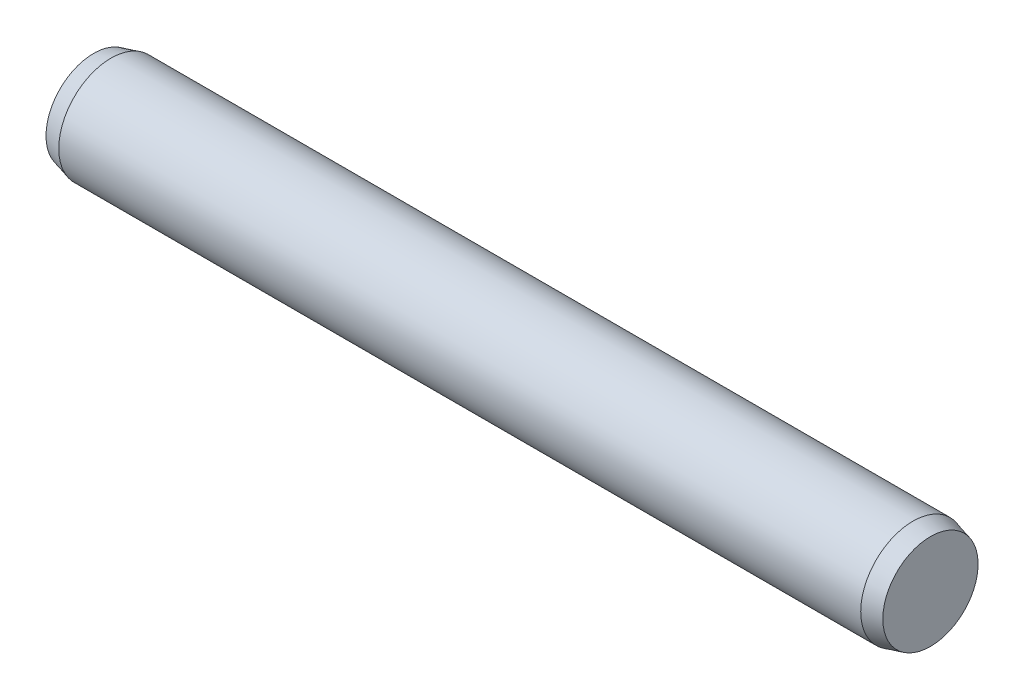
from build123d import *


with BuildPart() as part:
    # Sketch1 → Base-Revolve (revolve)
    with BuildSketch(Plane.XY, mode=Mode.PRIVATE) as base_revolve_sk:
        Polygon((0, 0), (24, 0), (24, 1.366025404), (23.5, 1.5), (0.5, 1.5), (0, 1.366025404), align=None)
    revolve(base_revolve_sk.sketch.rotate(Axis((-6.35, 0, 0), (1, 0, 0)), 90), axis=Axis((-6.35, 0, 0), (1, 0, 0)))


solid = part.part
